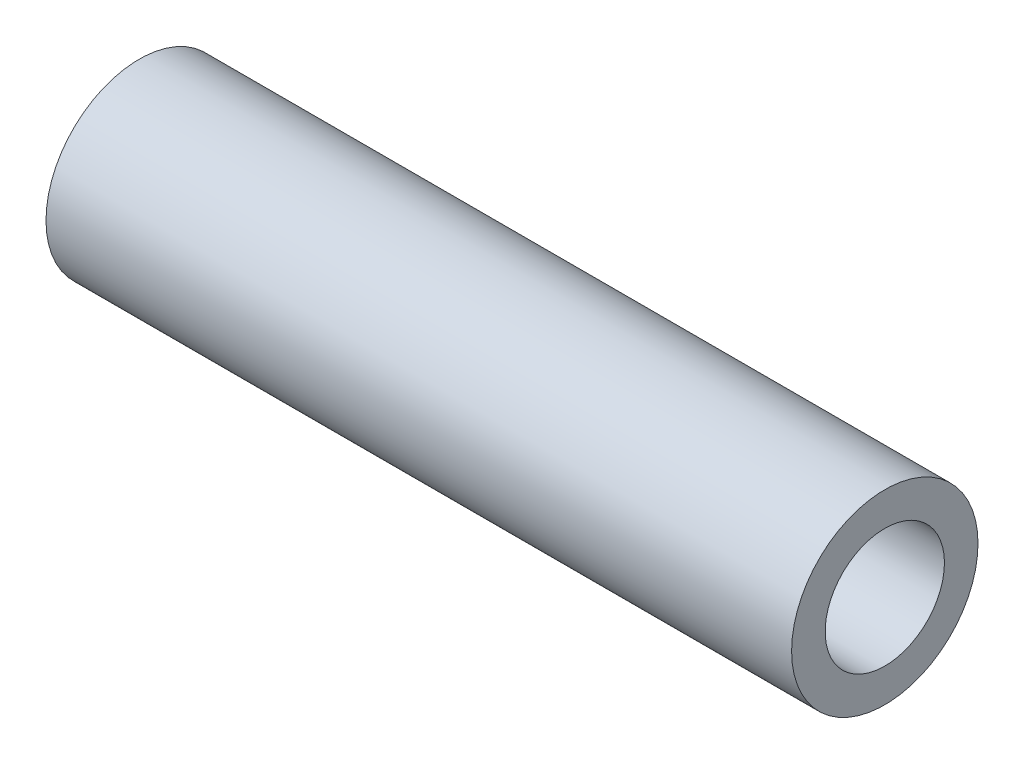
ISO-10303-21;
HEADER;
FILE_DESCRIPTION(('STEP AP214'),'2;1');
FILE_NAME('part.step','',(''),(''),'','','');
FILE_SCHEMA(('AUTOMOTIVE_DESIGN { 1 0 10303 214 1 1 1 1 }'));
ENDSEC;
DATA;
#1=APPLICATION_CONTEXT('core data for automotive mechanical design processes');
#2=APPLICATION_PROTOCOL_DEFINITION('international standard','automotive_design',2000,#1);
#3=PRODUCT_CONTEXT('',#1,'mechanical');
#4=PRODUCT('Part','Part','',(#3));
#5=PRODUCT_RELATED_PRODUCT_CATEGORY('part','',(#4));
#6=PRODUCT_DEFINITION_FORMATION('','',#4);
#7=PRODUCT_DEFINITION_CONTEXT('part definition',#1,'design');
#8=PRODUCT_DEFINITION('design','',#6,#7);
#9=PRODUCT_DEFINITION_SHAPE('','',#8);
#10=(LENGTH_UNIT() NAMED_UNIT(*) SI_UNIT(.MILLI.,.METRE.));
#11=(NAMED_UNIT(*) PLANE_ANGLE_UNIT() SI_UNIT($,.RADIAN.));
#12=(NAMED_UNIT(*) SI_UNIT($,.STERADIAN.) SOLID_ANGLE_UNIT());
#13=UNCERTAINTY_MEASURE_WITH_UNIT(LENGTH_MEASURE(1.E-05),#10,'distance_accuracy_value','');
#14=(GEOMETRIC_REPRESENTATION_CONTEXT(3) GLOBAL_UNCERTAINTY_ASSIGNED_CONTEXT((#13)) GLOBAL_UNIT_ASSIGNED_CONTEXT((#10,
#11,#12)) REPRESENTATION_CONTEXT('',''));
#15=CARTESIAN_POINT('',(0.,0.,0.));
#16=DIRECTION('',(0.,0.,1.));
#17=DIRECTION('',(1.,0.,0.));
#18=AXIS2_PLACEMENT_3D('',#15,#16,#17);
#19=CARTESIAN_POINT('',(100.,0.,0.));
#20=DIRECTION('',(1.,0.,0.));
#21=DIRECTION('',(0.,0.,-1.));
#22=AXIS2_PLACEMENT_3D('',#19,#20,#21);
#23=PLANE('',#22);
#24=CARTESIAN_POINT('',(100.,0.,0.));
#25=DIRECTION('',(1.,0.,0.));
#26=DIRECTION('',(0.,0.,-1.));
#27=AXIS2_PLACEMENT_3D('',#24,#25,#26);
#28=CIRCLE('',#27,25.);
#29=CARTESIAN_POINT('',(100.,0.,-25.));
#30=VERTEX_POINT('',#29);
#31=EDGE_CURVE('E10',#30,#30,#28,.T.);
#32=ORIENTED_EDGE('',*,*,#31,.T.);
#33=EDGE_LOOP('',(#32));
#34=FACE_BOUND('',#33,.T.);
#35=CARTESIAN_POINT('',(100.,0.,0.));
#36=DIRECTION('',(1.,0.,0.));
#37=DIRECTION('',(0.,0.,-1.));
#38=AXIS2_PLACEMENT_3D('',#35,#36,#37);
#39=CIRCLE('',#38,16.);
#40=CARTESIAN_POINT('',(100.,0.,-16.));
#41=VERTEX_POINT('',#40);
#42=EDGE_CURVE('E46',#41,#41,#39,.T.);
#43=ORIENTED_EDGE('',*,*,#42,.F.);
#44=EDGE_LOOP('',(#43));
#45=FACE_BOUND('',#44,.T.);
#46=ADVANCED_FACE('F32',(#34,#45),#23,.T.);
#47=CARTESIAN_POINT('',(-100.,0.,0.));
#48=DIRECTION('',(1.,0.,0.));
#49=DIRECTION('',(0.,0.,-1.));
#50=AXIS2_PLACEMENT_3D('',#47,#48,#49);
#51=PLANE('',#50);
#52=CARTESIAN_POINT('',(-100.,0.,0.));
#53=DIRECTION('',(1.,0.,0.));
#54=DIRECTION('',(0.,0.,-1.));
#55=AXIS2_PLACEMENT_3D('',#52,#53,#54);
#56=CIRCLE('',#55,25.);
#57=CARTESIAN_POINT('',(-100.,0.,-25.));
#58=VERTEX_POINT('',#57);
#59=EDGE_CURVE('E36',#58,#58,#56,.T.);
#60=ORIENTED_EDGE('',*,*,#59,.F.);
#61=EDGE_LOOP('',(#60));
#62=FACE_BOUND('',#61,.T.);
#63=CARTESIAN_POINT('',(-100.,0.,0.));
#64=DIRECTION('',(1.,0.,0.));
#65=DIRECTION('',(0.,0.,-1.));
#66=AXIS2_PLACEMENT_3D('',#63,#64,#65);
#67=CIRCLE('',#66,16.);
#68=CARTESIAN_POINT('',(-100.,0.,-16.));
#69=VERTEX_POINT('',#68);
#70=EDGE_CURVE('E48',#69,#69,#67,.T.);
#71=ORIENTED_EDGE('',*,*,#70,.T.);
#72=EDGE_LOOP('',(#71));
#73=FACE_BOUND('',#72,.T.);
#74=ADVANCED_FACE('F58',(#62,#73),#51,.F.);
#75=CARTESIAN_POINT('',(100.,0.,0.));
#76=DIRECTION('',(-1.,0.,0.));
#77=DIRECTION('',(0.,0.,1.));
#78=AXIS2_PLACEMENT_3D('',#75,#76,#77);
#79=CYLINDRICAL_SURFACE('',#78,25.);
#80=ORIENTED_EDGE('',*,*,#31,.F.);
#81=EDGE_LOOP('',(#80));
#82=FACE_BOUND('',#81,.T.);
#83=ORIENTED_EDGE('',*,*,#59,.T.);
#84=EDGE_LOOP('',(#83));
#85=FACE_BOUND('',#84,.T.);
#86=ADVANCED_FACE('F34',(#82,#85),#79,.T.);
#87=CARTESIAN_POINT('',(100.,0.,0.));
#88=DIRECTION('',(-1.,0.,0.));
#89=DIRECTION('',(0.,0.,1.));
#90=AXIS2_PLACEMENT_3D('',#87,#88,#89);
#91=CYLINDRICAL_SURFACE('',#90,16.);
#92=ORIENTED_EDGE('',*,*,#42,.T.);
#93=EDGE_LOOP('',(#92));
#94=FACE_BOUND('',#93,.T.);
#95=ORIENTED_EDGE('',*,*,#70,.F.);
#96=EDGE_LOOP('',(#95));
#97=FACE_BOUND('',#96,.T.);
#98=ADVANCED_FACE('F54',(#94,#97),#91,.F.);
#99=CLOSED_SHELL('',(#46,#74,#86,#98));
#100=MANIFOLD_SOLID_BREP('B2',#99);
#101=ADVANCED_BREP_SHAPE_REPRESENTATION('',(#18,#100),#14);
#102=SHAPE_DEFINITION_REPRESENTATION(#9,#101);
ENDSEC;
END-ISO-10303-21;
